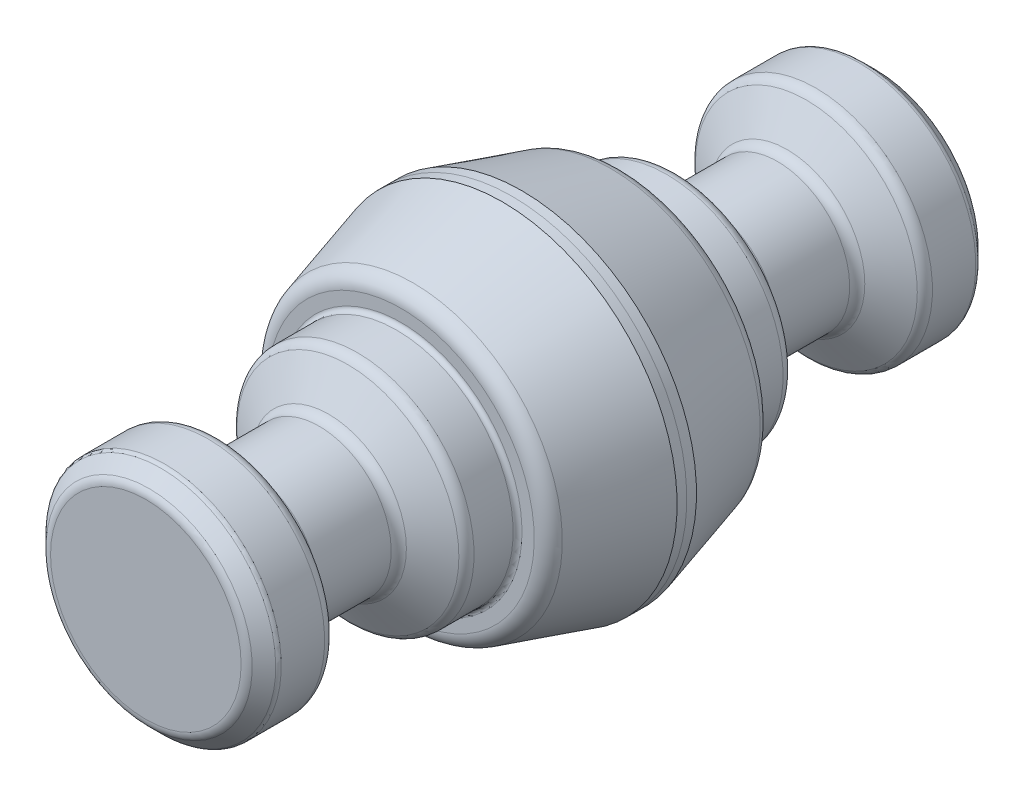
ISO-10303-21;
HEADER;
FILE_DESCRIPTION(('STEP AP214'),'2;1');
FILE_NAME('part.step','',(''),(''),'','','');
FILE_SCHEMA(('AUTOMOTIVE_DESIGN { 1 0 10303 214 1 1 1 1 }'));
ENDSEC;
DATA;
#1=APPLICATION_CONTEXT('core data for automotive mechanical design processes');
#2=APPLICATION_PROTOCOL_DEFINITION('international standard','automotive_design',2000,#1);
#3=PRODUCT_CONTEXT('',#1,'mechanical');
#4=PRODUCT('Part','Part','',(#3));
#5=PRODUCT_RELATED_PRODUCT_CATEGORY('part','',(#4));
#6=PRODUCT_DEFINITION_FORMATION('','',#4);
#7=PRODUCT_DEFINITION_CONTEXT('part definition',#1,'design');
#8=PRODUCT_DEFINITION('design','',#6,#7);
#9=PRODUCT_DEFINITION_SHAPE('','',#8);
#10=(LENGTH_UNIT() NAMED_UNIT(*) SI_UNIT(.MILLI.,.METRE.));
#11=(NAMED_UNIT(*) PLANE_ANGLE_UNIT() SI_UNIT($,.RADIAN.));
#12=(NAMED_UNIT(*) SI_UNIT($,.STERADIAN.) SOLID_ANGLE_UNIT());
#13=UNCERTAINTY_MEASURE_WITH_UNIT(LENGTH_MEASURE(1.E-05),#10,'distance_accuracy_value','');
#14=(GEOMETRIC_REPRESENTATION_CONTEXT(3) GLOBAL_UNCERTAINTY_ASSIGNED_CONTEXT((#13)) GLOBAL_UNIT_ASSIGNED_CONTEXT((#10,
#11,#12)) REPRESENTATION_CONTEXT('',''));
#15=CARTESIAN_POINT('',(0.,0.,0.));
#16=DIRECTION('',(0.,0.,1.));
#17=DIRECTION('',(1.,0.,0.));
#18=AXIS2_PLACEMENT_3D('',#15,#16,#17);
#19=CARTESIAN_POINT('',(0.,0.,0.));
#20=DIRECTION('',(0.,0.,-1.));
#21=DIRECTION('',(0.,-1.,0.));
#22=AXIS2_PLACEMENT_3D('',#19,#20,#21);
#23=CYLINDRICAL_SURFACE('',#22,6.5);
#24=CARTESIAN_POINT('',(0.,0.,17.3867513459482));
#25=DIRECTION('',(0.,0.,-1.));
#26=DIRECTION('',(0.,-1.,0.));
#27=AXIS2_PLACEMENT_3D('',#24,#25,#26);
#28=CIRCLE('',#27,6.5);
#29=CARTESIAN_POINT('',(0.,-6.5,17.3867513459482));
#30=VERTEX_POINT('',#29);
#31=EDGE_CURVE('E85',#30,#30,#28,.F.);
#32=ORIENTED_EDGE('',*,*,#31,.T.);
#33=EDGE_LOOP('',(#32));
#34=FACE_BOUND('',#33,.T.);
#35=CARTESIAN_POINT('',(0.,0.,23.9226497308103));
#36=DIRECTION('',(0.,0.,-1.));
#37=DIRECTION('',(0.,-1.,0.));
#38=AXIS2_PLACEMENT_3D('',#35,#36,#37);
#39=CIRCLE('',#38,6.5);
#40=CARTESIAN_POINT('',(0.,-6.5,23.9226497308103));
#41=VERTEX_POINT('',#40);
#42=EDGE_CURVE('E118',#41,#41,#39,.T.);
#43=ORIENTED_EDGE('',*,*,#42,.T.);
#44=EDGE_LOOP('',(#43));
#45=FACE_BOUND('',#44,.T.);
#46=ADVANCED_FACE('F12',(#34,#45),#23,.T.);
#47=CARTESIAN_POINT('',(0.,0.,0.));
#48=DIRECTION('',(0.,0.,-1.));
#49=DIRECTION('',(0.,-1.,0.));
#50=AXIS2_PLACEMENT_3D('',#47,#48,#49);
#51=CYLINDRICAL_SURFACE('',#50,10.5);
#52=CARTESIAN_POINT('',(0.,0.,27.3867513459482));
#53=DIRECTION('',(0.,0.,1.));
#54=DIRECTION('',(0.,1.,0.));
#55=AXIS2_PLACEMENT_3D('',#52,#53,#54);
#56=CIRCLE('',#55,10.5);
#57=CARTESIAN_POINT('',(0.,10.5,27.3867513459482));
#58=VERTEX_POINT('',#57);
#59=EDGE_CURVE('E8',#58,#58,#56,.T.);
#60=ORIENTED_EDGE('',*,*,#59,.T.);
#61=EDGE_LOOP('',(#60));
#62=FACE_BOUND('',#61,.T.);
#63=CARTESIAN_POINT('',(0.,0.,31.2928932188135));
#64=DIRECTION('',(0.,0.,1.));
#65=DIRECTION('',(0.,1.,0.));
#66=AXIS2_PLACEMENT_3D('',#63,#64,#65);
#67=CIRCLE('',#66,10.5);
#68=CARTESIAN_POINT('',(0.,10.5,31.2928932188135));
#69=VERTEX_POINT('',#68);
#70=EDGE_CURVE('E112',#69,#69,#67,.F.);
#71=ORIENTED_EDGE('',*,*,#70,.T.);
#72=EDGE_LOOP('',(#71));
#73=FACE_BOUND('',#72,.T.);
#74=ADVANCED_FACE('F174',(#62,#73),#51,.T.);
#75=CARTESIAN_POINT('',(0.,0.,24.5));
#76=DIRECTION('',(0.,0.,1.));
#77=DIRECTION('',(0.,1.,0.));
#78=AXIS2_PLACEMENT_3D('',#75,#76,#77);
#79=CONICAL_SURFACE('',#78,6.5,1.0471975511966);
#80=CARTESIAN_POINT('',(0.,0.,26.5207259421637));
#81=DIRECTION('',(0.,0.,-1.));
#82=DIRECTION('',(0.,-1.,0.));
#83=AXIS2_PLACEMENT_3D('',#80,#81,#82);
#84=CIRCLE('',#83,10.);
#85=CARTESIAN_POINT('',(0.,-10.,26.5207259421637));
#86=VERTEX_POINT('',#85);
#87=EDGE_CURVE('E19',#86,#86,#84,.T.);
#88=ORIENTED_EDGE('',*,*,#87,.T.);
#89=EDGE_LOOP('',(#88));
#90=FACE_BOUND('',#89,.T.);
#91=CARTESIAN_POINT('',(0.,0.,24.7886751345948));
#92=DIRECTION('',(0.,0.,1.));
#93=DIRECTION('',(0.,1.,0.));
#94=AXIS2_PLACEMENT_3D('',#91,#92,#93);
#95=CIRCLE('',#94,7.);
#96=CARTESIAN_POINT('',(0.,7.,24.7886751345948));
#97=VERTEX_POINT('',#96);
#98=EDGE_CURVE('E115',#97,#97,#95,.T.);
#99=ORIENTED_EDGE('',*,*,#98,.T.);
#100=EDGE_LOOP('',(#99));
#101=FACE_BOUND('',#100,.T.);
#102=ADVANCED_FACE('F181',(#90,#101),#79,.T.);
#103=CARTESIAN_POINT('',(0.,0.,31.5));
#104=DIRECTION('',(0.,0.,-1.));
#105=DIRECTION('',(0.,-1.,0.));
#106=AXIS2_PLACEMENT_3D('',#103,#104,#105);
#107=CONICAL_SURFACE('',#106,10.5,0.785398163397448);
#108=CARTESIAN_POINT('',(0.,0.,32.7071067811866));
#109=DIRECTION('',(0.,0.,1.));
#110=DIRECTION('',(0.,1.,0.));
#111=AXIS2_PLACEMENT_3D('',#108,#109,#110);
#112=CIRCLE('',#111,9.29289321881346);
#113=CARTESIAN_POINT('',(0.,9.29289321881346,32.7071067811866));
#114=VERTEX_POINT('',#113);
#115=EDGE_CURVE('E106',#114,#114,#112,.F.);
#116=ORIENTED_EDGE('',*,*,#115,.T.);
#117=EDGE_LOOP('',(#116));
#118=FACE_BOUND('',#117,.T.);
#119=CARTESIAN_POINT('',(0.,0.,31.6464466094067));
#120=DIRECTION('',(0.,0.,1.));
#121=DIRECTION('',(0.,1.,0.));
#122=AXIS2_PLACEMENT_3D('',#119,#120,#121);
#123=CIRCLE('',#122,10.3535533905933);
#124=CARTESIAN_POINT('',(0.,10.3535533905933,31.6464466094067));
#125=VERTEX_POINT('',#124);
#126=EDGE_CURVE('E109',#125,#125,#123,.T.);
#127=ORIENTED_EDGE('',*,*,#126,.T.);
#128=EDGE_LOOP('',(#127));
#129=FACE_BOUND('',#128,.T.);
#130=ADVANCED_FACE('F190',(#118,#129),#107,.T.);
#131=CARTESIAN_POINT('',(-12.,0.,33.));
#132=DIRECTION('',(0.,0.,1.));
#133=DIRECTION('',(0.,1.,0.));
#134=AXIS2_PLACEMENT_3D('',#131,#132,#133);
#135=PLANE('',#134);
#136=CARTESIAN_POINT('',(0.,0.,33.));
#137=DIRECTION('',(0.,0.,1.));
#138=DIRECTION('',(0.,1.,0.));
#139=AXIS2_PLACEMENT_3D('',#136,#137,#138);
#140=CIRCLE('',#139,8.58578643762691);
#141=CARTESIAN_POINT('',(0.,8.58578643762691,33.));
#142=VERTEX_POINT('',#141);
#143=EDGE_CURVE('E103',#142,#142,#140,.T.);
#144=ORIENTED_EDGE('',*,*,#143,.T.);
#145=EDGE_LOOP('',(#144));
#146=FACE_BOUND('',#145,.T.);
#147=ADVANCED_FACE('F186',(#146),#135,.T.);
#148=CARTESIAN_POINT('',(0.,0.,23.9226497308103));
#149=DIRECTION('',(0.,0.,-1.));
#150=DIRECTION('',(0.,-1.,0.));
#151=AXIS2_PLACEMENT_3D('',#148,#149,#150);
#152=TOROIDAL_SURFACE('',#151,7.5,1.);
#153=ORIENTED_EDGE('',*,*,#98,.F.);
#154=EDGE_LOOP('',(#153));
#155=FACE_BOUND('',#154,.T.);
#156=ORIENTED_EDGE('',*,*,#42,.F.);
#157=EDGE_LOOP('',(#156));
#158=FACE_BOUND('',#157,.T.);
#159=ADVANCED_FACE('F189',(#155,#158),#152,.F.);
#160=CARTESIAN_POINT('',(0.,0.,31.2928932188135));
#161=DIRECTION('',(0.,0.,1.));
#162=DIRECTION('',(0.,1.,0.));
#163=AXIS2_PLACEMENT_3D('',#160,#161,#162);
#164=TOROIDAL_SURFACE('',#163,10.,0.5);
#165=ORIENTED_EDGE('',*,*,#126,.F.);
#166=EDGE_LOOP('',(#165));
#167=FACE_BOUND('',#166,.T.);
#168=ORIENTED_EDGE('',*,*,#70,.F.);
#169=EDGE_LOOP('',(#168));
#170=FACE_BOUND('',#169,.T.);
#171=ADVANCED_FACE('F194',(#167,#170),#164,.T.);
#172=CARTESIAN_POINT('',(0.,0.,32.));
#173=DIRECTION('',(0.,0.,1.));
#174=DIRECTION('',(0.,1.,0.));
#175=AXIS2_PLACEMENT_3D('',#172,#173,#174);
#176=TOROIDAL_SURFACE('',#175,8.58578643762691,1.);
#177=ORIENTED_EDGE('',*,*,#143,.F.);
#178=EDGE_LOOP('',(#177));
#179=FACE_BOUND('',#178,.T.);
#180=ORIENTED_EDGE('',*,*,#115,.F.);
#181=EDGE_LOOP('',(#180));
#182=FACE_BOUND('',#181,.T.);
#183=ADVANCED_FACE('F198',(#179,#182),#176,.T.);
#184=CARTESIAN_POINT('',(0.,0.,16.8094010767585));
#185=DIRECTION('',(0.,0.,-1.));
#186=DIRECTION('',(0.,-1.,0.));
#187=AXIS2_PLACEMENT_3D('',#184,#185,#186);
#188=CONICAL_SURFACE('',#187,6.5,1.0471975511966);
#189=CARTESIAN_POINT('',(0.,0.,14.7886751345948));
#190=DIRECTION('',(0.,0.,1.));
#191=DIRECTION('',(0.,1.,0.));
#192=AXIS2_PLACEMENT_3D('',#189,#190,#191);
#193=CIRCLE('',#192,10.);
#194=CARTESIAN_POINT('',(0.,10.,14.7886751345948));
#195=VERTEX_POINT('',#194);
#196=EDGE_CURVE('E88',#195,#195,#193,.T.);
#197=ORIENTED_EDGE('',*,*,#196,.T.);
#198=EDGE_LOOP('',(#197));
#199=FACE_BOUND('',#198,.T.);
#200=CARTESIAN_POINT('',(0.,0.,16.5207259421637));
#201=DIRECTION('',(0.,0.,1.));
#202=DIRECTION('',(0.,1.,0.));
#203=AXIS2_PLACEMENT_3D('',#200,#201,#202);
#204=CIRCLE('',#203,7.);
#205=CARTESIAN_POINT('',(0.,7.,16.5207259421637));
#206=VERTEX_POINT('',#205);
#207=EDGE_CURVE('E91',#206,#206,#204,.F.);
#208=ORIENTED_EDGE('',*,*,#207,.T.);
#209=EDGE_LOOP('',(#208));
#210=FACE_BOUND('',#209,.T.);
#211=ADVANCED_FACE('F202',(#199,#210),#188,.T.);
#212=CARTESIAN_POINT('',(0.,0.,0.));
#213=DIRECTION('',(0.,0.,-1.));
#214=DIRECTION('',(0.,-1.,0.));
#215=AXIS2_PLACEMENT_3D('',#212,#213,#214);
#216=CYLINDRICAL_SURFACE('',#215,10.5);
#217=CARTESIAN_POINT('',(0.,0.,10.4));
#218=DIRECTION('',(0.,0.,-1.));
#219=DIRECTION('',(0.,-1.,0.));
#220=AXIS2_PLACEMENT_3D('',#217,#218,#219);
#221=CIRCLE('',#220,10.5);
#222=CARTESIAN_POINT('',(0.,-10.5,10.4));
#223=VERTEX_POINT('',#222);
#224=EDGE_CURVE('E82',#223,#223,#221,.F.);
#225=ORIENTED_EDGE('',*,*,#224,.T.);
#226=EDGE_LOOP('',(#225));
#227=FACE_BOUND('',#226,.T.);
#228=CARTESIAN_POINT('',(0.,0.,13.9226497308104));
#229=DIRECTION('',(0.,0.,1.));
#230=DIRECTION('',(0.,1.,0.));
#231=AXIS2_PLACEMENT_3D('',#228,#229,#230);
#232=CIRCLE('',#231,10.5);
#233=CARTESIAN_POINT('',(0.,10.5,13.9226497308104));
#234=VERTEX_POINT('',#233);
#235=EDGE_CURVE('E94',#234,#234,#232,.F.);
#236=ORIENTED_EDGE('',*,*,#235,.T.);
#237=EDGE_LOOP('',(#236));
#238=FACE_BOUND('',#237,.T.);
#239=ADVANCED_FACE('F278',(#227,#238),#216,.T.);
#240=CARTESIAN_POINT('',(0.,0.,0.));
#241=DIRECTION('',(0.,0.,-1.));
#242=DIRECTION('',(0.,-1.,0.));
#243=AXIS2_PLACEMENT_3D('',#240,#241,#242);
#244=CYLINDRICAL_SURFACE('',#243,15.75);
#245=CARTESIAN_POINT('',(0.,0.,0.));
#246=DIRECTION('',(0.,0.,1.));
#247=DIRECTION('',(0.,1.,0.));
#248=AXIS2_PLACEMENT_3D('',#245,#246,#247);
#249=CIRCLE('',#248,15.75);
#250=CARTESIAN_POINT('',(0.,15.75,0.));
#251=VERTEX_POINT('',#250);
#252=EDGE_CURVE('E125',#251,#251,#249,.T.);
#253=ORIENTED_EDGE('',*,*,#252,.T.);
#254=EDGE_LOOP('',(#253));
#255=FACE_BOUND('',#254,.T.);
#256=CARTESIAN_POINT('',(0.,0.,0.87185361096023));
#257=DIRECTION('',(0.,0.,-1.));
#258=DIRECTION('',(0.,-1.,0.));
#259=AXIS2_PLACEMENT_3D('',#256,#257,#258);
#260=CIRCLE('',#259,15.75);
#261=CARTESIAN_POINT('',(0.,-15.75,0.87185361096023));
#262=VERTEX_POINT('',#261);
#263=EDGE_CURVE('E36',#262,#262,#260,.T.);
#264=ORIENTED_EDGE('',*,*,#263,.T.);
#265=EDGE_LOOP('',(#264));
#266=FACE_BOUND('',#265,.T.);
#267=ADVANCED_FACE('F129',(#255,#266),#244,.T.);
#268=CARTESIAN_POINT('',(0.,0.,10.));
#269=DIRECTION('',(0.,0.,-1.));
#270=DIRECTION('',(0.,-1.,0.));
#271=AXIS2_PLACEMENT_3D('',#268,#269,#270);
#272=CONICAL_SURFACE('',#271,13.1325461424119,0.279252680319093);
#273=CARTESIAN_POINT('',(0.,0.,8.91345603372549));
#274=DIRECTION('',(0.,0.,1.));
#275=DIRECTION('',(0.,1.,0.));
#276=AXIS2_PLACEMENT_3D('',#273,#274,#275);
#277=CIRCLE('',#276,13.4441076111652);
#278=CARTESIAN_POINT('',(0.,13.4441076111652,8.91345603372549));
#279=VERTEX_POINT('',#278);
#280=EDGE_CURVE('E100',#279,#279,#277,.F.);
#281=ORIENTED_EDGE('',*,*,#280,.T.);
#282=EDGE_LOOP('',(#281));
#283=FACE_BOUND('',#282,.T.);
#284=ORIENTED_EDGE('',*,*,#263,.F.);
#285=EDGE_LOOP('',(#284));
#286=FACE_BOUND('',#285,.T.);
#287=ADVANCED_FACE('F208',(#283,#286),#272,.T.);
#288=CARTESIAN_POINT('',(0.,0.,8.5));
#289=DIRECTION('',(0.,0.,-1.));
#290=DIRECTION('',(0.,-1.,0.));
#291=AXIS2_PLACEMENT_3D('',#288,#289,#290);
#292=TOROIDAL_SURFACE('',#291,12.0022150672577,1.5);
#293=CARTESIAN_POINT('',(0.,0.,10.));
#294=DIRECTION('',(0.,0.,-1.));
#295=DIRECTION('',(0.,-1.,0.));
#296=AXIS2_PLACEMENT_3D('',#293,#294,#295);
#297=CIRCLE('',#296,12.0022150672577);
#298=CARTESIAN_POINT('',(0.,-12.0022150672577,10.));
#299=VERTEX_POINT('',#298);
#300=EDGE_CURVE('E97',#299,#299,#297,.F.);
#301=ORIENTED_EDGE('',*,*,#300,.F.);
#302=EDGE_LOOP('',(#301));
#303=FACE_BOUND('',#302,.T.);
#304=ORIENTED_EDGE('',*,*,#280,.F.);
#305=EDGE_LOOP('',(#304));
#306=FACE_BOUND('',#305,.T.);
#307=ADVANCED_FACE('F204',(#303,#306),#292,.T.);
#308=CARTESIAN_POINT('',(-13.1325461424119,0.,10.));
#309=DIRECTION('',(0.,0.,-1.));
#310=DIRECTION('',(0.,-1.,0.));
#311=AXIS2_PLACEMENT_3D('',#308,#309,#310);
#312=PLANE('',#311);
#313=CARTESIAN_POINT('',(0.,0.,10.));
#314=DIRECTION('',(0.,0.,-1.));
#315=DIRECTION('',(0.,-1.,0.));
#316=AXIS2_PLACEMENT_3D('',#313,#314,#315);
#317=CIRCLE('',#316,10.9);
#318=CARTESIAN_POINT('',(0.,-10.9,10.));
#319=VERTEX_POINT('',#318);
#320=EDGE_CURVE('E79',#319,#319,#317,.T.);
#321=ORIENTED_EDGE('',*,*,#320,.T.);
#322=EDGE_LOOP('',(#321));
#323=FACE_BOUND('',#322,.T.);
#324=ORIENTED_EDGE('',*,*,#300,.T.);
#325=EDGE_LOOP('',(#324));
#326=FACE_BOUND('',#325,.T.);
#327=ADVANCED_FACE('F207',(#323,#326),#312,.F.);
#328=CARTESIAN_POINT('',(0.,0.,13.9226497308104));
#329=DIRECTION('',(0.,0.,1.));
#330=DIRECTION('',(0.,1.,0.));
#331=AXIS2_PLACEMENT_3D('',#328,#329,#330);
#332=TOROIDAL_SURFACE('',#331,9.5,1.);
#333=ORIENTED_EDGE('',*,*,#196,.F.);
#334=EDGE_LOOP('',(#333));
#335=FACE_BOUND('',#334,.T.);
#336=ORIENTED_EDGE('',*,*,#235,.F.);
#337=EDGE_LOOP('',(#336));
#338=FACE_BOUND('',#337,.T.);
#339=ADVANCED_FACE('F210',(#335,#338),#332,.T.);
#340=CARTESIAN_POINT('',(0.,0.,17.3867513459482));
#341=DIRECTION('',(0.,0.,-1.));
#342=DIRECTION('',(0.,-1.,0.));
#343=AXIS2_PLACEMENT_3D('',#340,#341,#342);
#344=TOROIDAL_SURFACE('',#343,7.5,1.);
#345=ORIENTED_EDGE('',*,*,#31,.F.);
#346=EDGE_LOOP('',(#345));
#347=FACE_BOUND('',#346,.T.);
#348=ORIENTED_EDGE('',*,*,#207,.F.);
#349=EDGE_LOOP('',(#348));
#350=FACE_BOUND('',#349,.T.);
#351=ADVANCED_FACE('F213',(#347,#350),#344,.F.);
#352=CARTESIAN_POINT('',(0.,0.,10.4));
#353=DIRECTION('',(0.,0.,-1.));
#354=DIRECTION('',(0.,-1.,0.));
#355=AXIS2_PLACEMENT_3D('',#352,#353,#354);
#356=TOROIDAL_SURFACE('',#355,10.9,0.4);
#357=ORIENTED_EDGE('',*,*,#320,.F.);
#358=EDGE_LOOP('',(#357));
#359=FACE_BOUND('',#358,.T.);
#360=ORIENTED_EDGE('',*,*,#224,.F.);
#361=EDGE_LOOP('',(#360));
#362=FACE_BOUND('',#361,.T.);
#363=ADVANCED_FACE('F142',(#359,#362),#356,.F.);
#364=CARTESIAN_POINT('',(0.,0.,0.));
#365=DIRECTION('',(0.,0.,1.));
#366=DIRECTION('',(0.,1.,0.));
#367=AXIS2_PLACEMENT_3D('',#364,#365,#366);
#368=CYLINDRICAL_SURFACE('',#367,15.7495);
#369=CARTESIAN_POINT('',(0.,0.,0.));
#370=DIRECTION('',(0.,0.,1.));
#371=DIRECTION('',(0.,1.,0.));
#372=AXIS2_PLACEMENT_3D('',#369,#370,#371);
#373=CIRCLE('',#372,15.7495);
#374=CARTESIAN_POINT('',(0.,15.7495,0.));
#375=VERTEX_POINT('',#374);
#376=EDGE_CURVE('E37',#375,#375,#373,.T.);
#377=ORIENTED_EDGE('',*,*,#376,.F.);
#378=EDGE_LOOP('',(#377));
#379=FACE_BOUND('',#378,.T.);
#380=CARTESIAN_POINT('',(0.,0.,-0.873597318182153));
#381=DIRECTION('',(0.,0.,1.));
#382=DIRECTION('',(0.,1.,0.));
#383=AXIS2_PLACEMENT_3D('',#380,#381,#382);
#384=CIRCLE('',#383,15.7495);
#385=CARTESIAN_POINT('',(0.,15.7495,-0.873597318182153));
#386=VERTEX_POINT('',#385);
#387=EDGE_CURVE('E33',#386,#386,#384,.F.);
#388=ORIENTED_EDGE('',*,*,#387,.F.);
#389=EDGE_LOOP('',(#388));
#390=FACE_BOUND('',#389,.T.);
#391=ADVANCED_FACE('F136',(#379,#390),#368,.T.);
#392=CARTESIAN_POINT('',(-15.7495,0.,0.));
#393=DIRECTION('',(0.,0.,1.));
#394=DIRECTION('',(0.,1.,0.));
#395=AXIS2_PLACEMENT_3D('',#392,#393,#394);
#396=PLANE('',#395);
#397=ORIENTED_EDGE('',*,*,#252,.F.);
#398=EDGE_LOOP('',(#397));
#399=FACE_BOUND('',#398,.T.);
#400=ORIENTED_EDGE('',*,*,#376,.T.);
#401=EDGE_LOOP('',(#400));
#402=FACE_BOUND('',#401,.T.);
#403=ADVANCED_FACE('F132',(#399,#402),#396,.F.);
#404=CARTESIAN_POINT('',(-12.,0.,-33.));
#405=DIRECTION('',(0.,0.,-1.));
#406=DIRECTION('',(0.,1.,0.));
#407=AXIS2_PLACEMENT_3D('',#404,#405,#406);
#408=PLANE('',#407);
#409=CARTESIAN_POINT('',(0.,0.,-33.));
#410=DIRECTION('',(0.,0.,-1.));
#411=DIRECTION('',(0.,-1.,0.));
#412=AXIS2_PLACEMENT_3D('',#409,#410,#411);
#413=CIRCLE('',#412,8.58578643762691);
#414=CARTESIAN_POINT('',(0.,-8.58578643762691,-33.));
#415=VERTEX_POINT('',#414);
#416=EDGE_CURVE('E64',#415,#415,#413,.T.);
#417=ORIENTED_EDGE('',*,*,#416,.T.);
#418=EDGE_LOOP('',(#417));
#419=FACE_BOUND('',#418,.T.);
#420=ADVANCED_FACE('F135',(#419),#408,.T.);
#421=CARTESIAN_POINT('',(0.,0.,-32.));
#422=DIRECTION('',(0.,0.,-1.));
#423=DIRECTION('',(0.,-1.,0.));
#424=AXIS2_PLACEMENT_3D('',#421,#422,#423);
#425=TOROIDAL_SURFACE('',#424,8.58578643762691,1.);
#426=CARTESIAN_POINT('',(0.,0.,-32.7071067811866));
#427=DIRECTION('',(0.,0.,-1.));
#428=DIRECTION('',(0.,-1.,0.));
#429=AXIS2_PLACEMENT_3D('',#426,#427,#428);
#430=CIRCLE('',#429,9.29289321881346);
#431=CARTESIAN_POINT('',(0.,-9.29289321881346,-32.7071067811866));
#432=VERTEX_POINT('',#431);
#433=EDGE_CURVE('E61',#432,#432,#430,.F.);
#434=ORIENTED_EDGE('',*,*,#433,.F.);
#435=EDGE_LOOP('',(#434));
#436=FACE_BOUND('',#435,.T.);
#437=ORIENTED_EDGE('',*,*,#416,.F.);
#438=EDGE_LOOP('',(#437));
#439=FACE_BOUND('',#438,.T.);
#440=ADVANCED_FACE('F233',(#436,#439),#425,.T.);
#441=CARTESIAN_POINT('',(0.,0.,-31.5));
#442=DIRECTION('',(0.,0.,1.));
#443=DIRECTION('',(0.,-1.,0.));
#444=AXIS2_PLACEMENT_3D('',#441,#442,#443);
#445=CONICAL_SURFACE('',#444,10.5,0.785398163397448);
#446=ORIENTED_EDGE('',*,*,#433,.T.);
#447=EDGE_LOOP('',(#446));
#448=FACE_BOUND('',#447,.T.);
#449=CARTESIAN_POINT('',(0.,0.,-31.6464466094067));
#450=DIRECTION('',(0.,0.,-1.));
#451=DIRECTION('',(0.,-1.,0.));
#452=AXIS2_PLACEMENT_3D('',#449,#450,#451);
#453=CIRCLE('',#452,10.3535533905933);
#454=CARTESIAN_POINT('',(0.,-10.3535533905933,-31.6464466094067));
#455=VERTEX_POINT('',#454);
#456=EDGE_CURVE('E70',#455,#455,#453,.T.);
#457=ORIENTED_EDGE('',*,*,#456,.T.);
#458=EDGE_LOOP('',(#457));
#459=FACE_BOUND('',#458,.T.);
#460=ADVANCED_FACE('F231',(#448,#459),#445,.T.);
#461=CARTESIAN_POINT('',(0.,0.,-31.2928932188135));
#462=DIRECTION('',(0.,0.,1.));
#463=DIRECTION('',(0.,1.,0.));
#464=AXIS2_PLACEMENT_3D('',#461,#462,#463);
#465=TOROIDAL_SURFACE('',#464,10.,0.5);
#466=CARTESIAN_POINT('',(0.,0.,-31.2928932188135));
#467=DIRECTION('',(0.,0.,1.));
#468=DIRECTION('',(0.,1.,0.));
#469=AXIS2_PLACEMENT_3D('',#466,#467,#468);
#470=CIRCLE('',#469,10.5);
#471=CARTESIAN_POINT('',(0.,10.5,-31.2928932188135));
#472=VERTEX_POINT('',#471);
#473=EDGE_CURVE('E67',#472,#472,#470,.T.);
#474=ORIENTED_EDGE('',*,*,#473,.F.);
#475=EDGE_LOOP('',(#474));
#476=FACE_BOUND('',#475,.T.);
#477=ORIENTED_EDGE('',*,*,#456,.F.);
#478=EDGE_LOOP('',(#477));
#479=FACE_BOUND('',#478,.T.);
#480=ADVANCED_FACE('F227',(#476,#479),#465,.T.);
#481=CARTESIAN_POINT('',(0.,0.,0.));
#482=DIRECTION('',(0.,0.,1.));
#483=DIRECTION('',(0.,-1.,0.));
#484=AXIS2_PLACEMENT_3D('',#481,#482,#483);
#485=CYLINDRICAL_SURFACE('',#484,10.5);
#486=CARTESIAN_POINT('',(0.,0.,-27.3867513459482));
#487=DIRECTION('',(0.,0.,1.));
#488=DIRECTION('',(0.,1.,0.));
#489=AXIS2_PLACEMENT_3D('',#486,#487,#488);
#490=CIRCLE('',#489,10.5);
#491=CARTESIAN_POINT('',(0.,10.5,-27.3867513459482));
#492=VERTEX_POINT('',#491);
#493=EDGE_CURVE('E27',#492,#492,#490,.F.);
#494=ORIENTED_EDGE('',*,*,#493,.T.);
#495=EDGE_LOOP('',(#494));
#496=FACE_BOUND('',#495,.T.);
#497=ORIENTED_EDGE('',*,*,#473,.T.);
#498=EDGE_LOOP('',(#497));
#499=FACE_BOUND('',#498,.T.);
#500=ADVANCED_FACE('F230',(#496,#499),#485,.T.);
#501=CARTESIAN_POINT('',(0.,0.,-24.5));
#502=DIRECTION('',(0.,0.,-1.));
#503=DIRECTION('',(0.,1.,0.));
#504=AXIS2_PLACEMENT_3D('',#501,#502,#503);
#505=CONICAL_SURFACE('',#504,6.5,1.0471975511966);
#506=CARTESIAN_POINT('',(0.,0.,-26.5207259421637));
#507=DIRECTION('',(0.,0.,1.));
#508=DIRECTION('',(0.,1.,0.));
#509=AXIS2_PLACEMENT_3D('',#506,#507,#508);
#510=CIRCLE('',#509,10.);
#511=CARTESIAN_POINT('',(0.,10.,-26.5207259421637));
#512=VERTEX_POINT('',#511);
#513=EDGE_CURVE('E23',#512,#512,#510,.T.);
#514=ORIENTED_EDGE('',*,*,#513,.T.);
#515=EDGE_LOOP('',(#514));
#516=FACE_BOUND('',#515,.T.);
#517=CARTESIAN_POINT('',(0.,0.,-24.7886751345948));
#518=DIRECTION('',(0.,0.,-1.));
#519=DIRECTION('',(0.,-1.,0.));
#520=AXIS2_PLACEMENT_3D('',#517,#518,#519);
#521=CIRCLE('',#520,7.);
#522=CARTESIAN_POINT('',(0.,-7.,-24.7886751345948));
#523=VERTEX_POINT('',#522);
#524=EDGE_CURVE('E76',#523,#523,#521,.T.);
#525=ORIENTED_EDGE('',*,*,#524,.T.);
#526=EDGE_LOOP('',(#525));
#527=FACE_BOUND('',#526,.T.);
#528=ADVANCED_FACE('F225',(#516,#527),#505,.T.);
#529=CARTESIAN_POINT('',(0.,0.,-23.9226497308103));
#530=DIRECTION('',(0.,0.,-1.));
#531=DIRECTION('',(0.,-1.,0.));
#532=AXIS2_PLACEMENT_3D('',#529,#530,#531);
#533=TOROIDAL_SURFACE('',#532,7.5,1.);
#534=CARTESIAN_POINT('',(0.,0.,-23.9226497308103));
#535=DIRECTION('',(0.,0.,-1.));
#536=DIRECTION('',(0.,-1.,0.));
#537=AXIS2_PLACEMENT_3D('',#534,#535,#536);
#538=CIRCLE('',#537,6.5);
#539=CARTESIAN_POINT('',(0.,-6.5,-23.9226497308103));
#540=VERTEX_POINT('',#539);
#541=EDGE_CURVE('E73',#540,#540,#538,.F.);
#542=ORIENTED_EDGE('',*,*,#541,.F.);
#543=EDGE_LOOP('',(#542));
#544=FACE_BOUND('',#543,.T.);
#545=ORIENTED_EDGE('',*,*,#524,.F.);
#546=EDGE_LOOP('',(#545));
#547=FACE_BOUND('',#546,.T.);
#548=ADVANCED_FACE('F221',(#544,#547),#533,.F.);
#549=CARTESIAN_POINT('',(0.,0.,0.));
#550=DIRECTION('',(0.,0.,1.));
#551=DIRECTION('',(0.,-1.,0.));
#552=AXIS2_PLACEMENT_3D('',#549,#550,#551);
#553=CYLINDRICAL_SURFACE('',#552,6.5);
#554=CARTESIAN_POINT('',(0.,0.,-17.3867513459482));
#555=DIRECTION('',(0.,0.,-1.));
#556=DIRECTION('',(0.,-1.,0.));
#557=AXIS2_PLACEMENT_3D('',#554,#555,#556);
#558=CIRCLE('',#557,6.5);
#559=CARTESIAN_POINT('',(0.,-6.5,-17.3867513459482));
#560=VERTEX_POINT('',#559);
#561=EDGE_CURVE('E43',#560,#560,#558,.T.);
#562=ORIENTED_EDGE('',*,*,#561,.T.);
#563=EDGE_LOOP('',(#562));
#564=FACE_BOUND('',#563,.T.);
#565=ORIENTED_EDGE('',*,*,#541,.T.);
#566=EDGE_LOOP('',(#565));
#567=FACE_BOUND('',#566,.T.);
#568=ADVANCED_FACE('F224',(#564,#567),#553,.T.);
#569=CARTESIAN_POINT('',(0.,0.,-17.3867513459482));
#570=DIRECTION('',(0.,0.,-1.));
#571=DIRECTION('',(0.,-1.,0.));
#572=AXIS2_PLACEMENT_3D('',#569,#570,#571);
#573=TOROIDAL_SURFACE('',#572,7.5,1.);
#574=CARTESIAN_POINT('',(0.,0.,-16.5207259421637));
#575=DIRECTION('',(0.,0.,-1.));
#576=DIRECTION('',(0.,-1.,0.));
#577=AXIS2_PLACEMENT_3D('',#574,#575,#576);
#578=CIRCLE('',#577,7.);
#579=CARTESIAN_POINT('',(0.,-7.,-16.5207259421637));
#580=VERTEX_POINT('',#579);
#581=EDGE_CURVE('E52',#580,#580,#578,.F.);
#582=ORIENTED_EDGE('',*,*,#581,.F.);
#583=EDGE_LOOP('',(#582));
#584=FACE_BOUND('',#583,.T.);
#585=ORIENTED_EDGE('',*,*,#561,.F.);
#586=EDGE_LOOP('',(#585));
#587=FACE_BOUND('',#586,.T.);
#588=ADVANCED_FACE('F242',(#584,#587),#573,.F.);
#589=CARTESIAN_POINT('',(0.,0.,-16.8094010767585));
#590=DIRECTION('',(0.,0.,1.));
#591=DIRECTION('',(0.,-1.,0.));
#592=AXIS2_PLACEMENT_3D('',#589,#590,#591);
#593=CONICAL_SURFACE('',#592,6.5,1.0471975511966);
#594=CARTESIAN_POINT('',(0.,0.,-14.7886751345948));
#595=DIRECTION('',(0.,0.,-1.));
#596=DIRECTION('',(0.,-1.,0.));
#597=AXIS2_PLACEMENT_3D('',#594,#595,#596);
#598=CIRCLE('',#597,10.);
#599=CARTESIAN_POINT('',(0.,-10.,-14.7886751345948));
#600=VERTEX_POINT('',#599);
#601=EDGE_CURVE('E49',#600,#600,#598,.T.);
#602=ORIENTED_EDGE('',*,*,#601,.T.);
#603=EDGE_LOOP('',(#602));
#604=FACE_BOUND('',#603,.T.);
#605=ORIENTED_EDGE('',*,*,#581,.T.);
#606=EDGE_LOOP('',(#605));
#607=FACE_BOUND('',#606,.T.);
#608=ADVANCED_FACE('F240',(#604,#607),#593,.T.);
#609=CARTESIAN_POINT('',(0.,0.,-13.9226497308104));
#610=DIRECTION('',(0.,0.,1.));
#611=DIRECTION('',(0.,1.,0.));
#612=AXIS2_PLACEMENT_3D('',#609,#610,#611);
#613=TOROIDAL_SURFACE('',#612,9.5,1.);
#614=CARTESIAN_POINT('',(0.,0.,-13.9226497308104));
#615=DIRECTION('',(0.,0.,1.));
#616=DIRECTION('',(0.,1.,0.));
#617=AXIS2_PLACEMENT_3D('',#614,#615,#616);
#618=CIRCLE('',#617,10.5);
#619=CARTESIAN_POINT('',(0.,10.5,-13.9226497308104));
#620=VERTEX_POINT('',#619);
#621=EDGE_CURVE('E46',#620,#620,#618,.T.);
#622=ORIENTED_EDGE('',*,*,#621,.F.);
#623=EDGE_LOOP('',(#622));
#624=FACE_BOUND('',#623,.T.);
#625=ORIENTED_EDGE('',*,*,#601,.F.);
#626=EDGE_LOOP('',(#625));
#627=FACE_BOUND('',#626,.T.);
#628=ADVANCED_FACE('F237',(#624,#627),#613,.T.);
#629=CARTESIAN_POINT('',(0.,0.,0.));
#630=DIRECTION('',(0.,0.,1.));
#631=DIRECTION('',(0.,-1.,0.));
#632=AXIS2_PLACEMENT_3D('',#629,#630,#631);
#633=CYLINDRICAL_SURFACE('',#632,10.5);
#634=CARTESIAN_POINT('',(0.,0.,-10.4));
#635=DIRECTION('',(0.,0.,1.));
#636=DIRECTION('',(0.,1.,0.));
#637=AXIS2_PLACEMENT_3D('',#634,#635,#636);
#638=CIRCLE('',#637,10.5);
#639=CARTESIAN_POINT('',(0.,10.5,-10.4));
#640=VERTEX_POINT('',#639);
#641=EDGE_CURVE('E40',#640,#640,#638,.F.);
#642=ORIENTED_EDGE('',*,*,#641,.T.);
#643=EDGE_LOOP('',(#642));
#644=FACE_BOUND('',#643,.T.);
#645=ORIENTED_EDGE('',*,*,#621,.T.);
#646=EDGE_LOOP('',(#645));
#647=FACE_BOUND('',#646,.T.);
#648=ADVANCED_FACE('F169',(#644,#647),#633,.T.);
#649=CARTESIAN_POINT('',(0.,0.,-10.4));
#650=DIRECTION('',(0.,0.,1.));
#651=DIRECTION('',(0.,1.,0.));
#652=AXIS2_PLACEMENT_3D('',#649,#650,#651);
#653=TOROIDAL_SURFACE('',#652,10.9,0.4);
#654=CARTESIAN_POINT('',(0.,0.,-10.));
#655=DIRECTION('',(0.,0.,1.));
#656=DIRECTION('',(0.,1.,0.));
#657=AXIS2_PLACEMENT_3D('',#654,#655,#656);
#658=CIRCLE('',#657,10.9);
#659=CARTESIAN_POINT('',(0.,10.9,-10.));
#660=VERTEX_POINT('',#659);
#661=EDGE_CURVE('E32',#660,#660,#658,.T.);
#662=ORIENTED_EDGE('',*,*,#661,.F.);
#663=EDGE_LOOP('',(#662));
#664=FACE_BOUND('',#663,.T.);
#665=ORIENTED_EDGE('',*,*,#641,.F.);
#666=EDGE_LOOP('',(#665));
#667=FACE_BOUND('',#666,.T.);
#668=ADVANCED_FACE('F161',(#664,#667),#653,.F.);
#669=CARTESIAN_POINT('',(-13.1325461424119,0.,-10.));
#670=DIRECTION('',(0.,0.,1.));
#671=DIRECTION('',(0.,-1.,0.));
#672=AXIS2_PLACEMENT_3D('',#669,#670,#671);
#673=PLANE('',#672);
#674=ORIENTED_EDGE('',*,*,#661,.T.);
#675=EDGE_LOOP('',(#674));
#676=FACE_BOUND('',#675,.T.);
#677=CARTESIAN_POINT('',(0.,0.,-10.));
#678=DIRECTION('',(0.,0.,1.));
#679=DIRECTION('',(0.,1.,0.));
#680=AXIS2_PLACEMENT_3D('',#677,#678,#679);
#681=CIRCLE('',#680,12.0022150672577);
#682=CARTESIAN_POINT('',(0.,12.0022150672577,-10.));
#683=VERTEX_POINT('',#682);
#684=EDGE_CURVE('E58',#683,#683,#681,.F.);
#685=ORIENTED_EDGE('',*,*,#684,.T.);
#686=EDGE_LOOP('',(#685));
#687=FACE_BOUND('',#686,.T.);
#688=ADVANCED_FACE('F156',(#676,#687),#673,.F.);
#689=CARTESIAN_POINT('',(0.,0.,-8.5));
#690=DIRECTION('',(0.,0.,1.));
#691=DIRECTION('',(0.,1.,0.));
#692=AXIS2_PLACEMENT_3D('',#689,#690,#691);
#693=TOROIDAL_SURFACE('',#692,12.0022150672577,1.5);
#694=CARTESIAN_POINT('',(0.,0.,-8.91345603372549));
#695=DIRECTION('',(0.,0.,-1.));
#696=DIRECTION('',(0.,-1.,0.));
#697=AXIS2_PLACEMENT_3D('',#694,#695,#696);
#698=CIRCLE('',#697,13.4441076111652);
#699=CARTESIAN_POINT('',(0.,-13.4441076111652,-8.91345603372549));
#700=VERTEX_POINT('',#699);
#701=EDGE_CURVE('E55',#700,#700,#698,.F.);
#702=ORIENTED_EDGE('',*,*,#701,.F.);
#703=EDGE_LOOP('',(#702));
#704=FACE_BOUND('',#703,.T.);
#705=ORIENTED_EDGE('',*,*,#684,.F.);
#706=EDGE_LOOP('',(#705));
#707=FACE_BOUND('',#706,.T.);
#708=ADVANCED_FACE('F150',(#704,#707),#693,.T.);
#709=CARTESIAN_POINT('',(0.,0.,-10.));
#710=DIRECTION('',(0.,0.,1.));
#711=DIRECTION('',(0.,-1.,0.));
#712=AXIS2_PLACEMENT_3D('',#709,#710,#711);
#713=CONICAL_SURFACE('',#712,13.1325461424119,0.279252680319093);
#714=ORIENTED_EDGE('',*,*,#387,.T.);
#715=EDGE_LOOP('',(#714));
#716=FACE_BOUND('',#715,.T.);
#717=ORIENTED_EDGE('',*,*,#701,.T.);
#718=EDGE_LOOP('',(#717));
#719=FACE_BOUND('',#718,.T.);
#720=ADVANCED_FACE('F146',(#716,#719),#713,.T.);
#721=CARTESIAN_POINT('',(0.,0.,-27.3867513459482));
#722=DIRECTION('',(0.,0.,1.));
#723=DIRECTION('',(0.,1.,0.));
#724=AXIS2_PLACEMENT_3D('',#721,#722,#723);
#725=TOROIDAL_SURFACE('',#724,9.5,1.);
#726=ORIENTED_EDGE('',*,*,#513,.F.);
#727=EDGE_LOOP('',(#726));
#728=FACE_BOUND('',#727,.T.);
#729=ORIENTED_EDGE('',*,*,#493,.F.);
#730=EDGE_LOOP('',(#729));
#731=FACE_BOUND('',#730,.T.);
#732=ADVANCED_FACE('F149',(#728,#731),#725,.T.);
#733=CARTESIAN_POINT('',(0.,0.,27.3867513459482));
#734=DIRECTION('',(0.,0.,1.));
#735=DIRECTION('',(0.,1.,0.));
#736=AXIS2_PLACEMENT_3D('',#733,#734,#735);
#737=TOROIDAL_SURFACE('',#736,9.5,1.);
#738=ORIENTED_EDGE('',*,*,#59,.F.);
#739=EDGE_LOOP('',(#738));
#740=FACE_BOUND('',#739,.T.);
#741=ORIENTED_EDGE('',*,*,#87,.F.);
#742=EDGE_LOOP('',(#741));
#743=FACE_BOUND('',#742,.T.);
#744=ADVANCED_FACE('F14',(#740,#743),#737,.T.);
#745=CLOSED_SHELL('',(#46,#74,#102,#130,#147,#159,#171,#183,#211,#239,#267,#287,#307,#327,#339,
#351,#363,#391,#403,#420,#440,#460,#480,#500,#528,#548,#568,#588,#608,#628,#648,#668,#688,#708,
#720,#732,#744));
#746=MANIFOLD_SOLID_BREP('B1',#745);
#747=ADVANCED_BREP_SHAPE_REPRESENTATION('',(#18,#746),#14);
#748=SHAPE_DEFINITION_REPRESENTATION(#9,#747);
ENDSEC;
END-ISO-10303-21;
